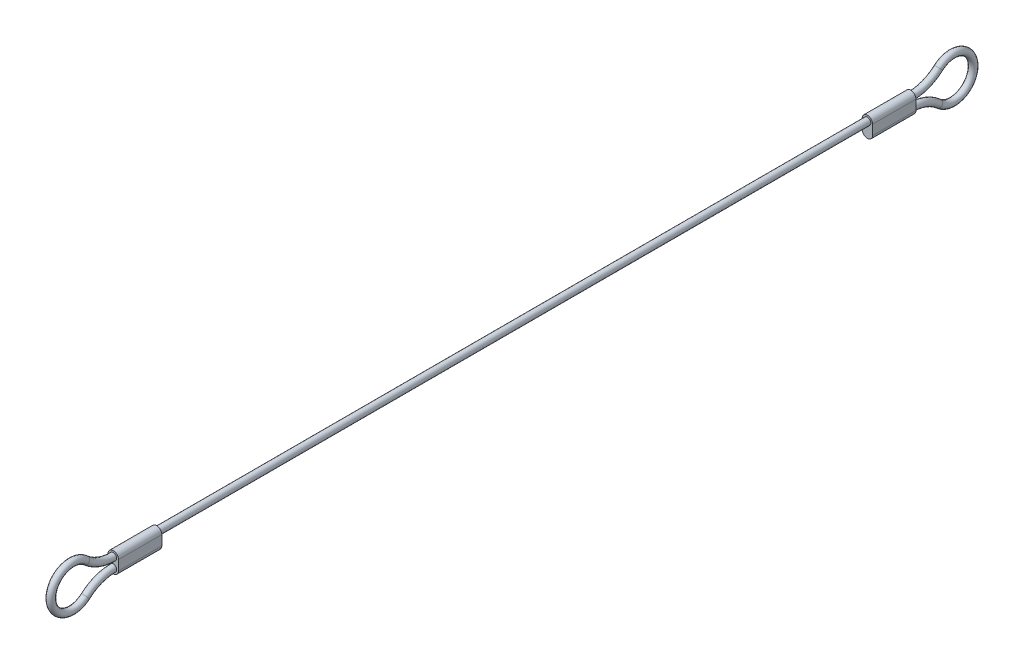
ISO-10303-21;
HEADER;
FILE_DESCRIPTION(('STEP AP214'),'2;1');
FILE_NAME('part.step','',(''),(''),'','','');
FILE_SCHEMA(('AUTOMOTIVE_DESIGN { 1 0 10303 214 1 1 1 1 }'));
ENDSEC;
DATA;
#1=APPLICATION_CONTEXT('core data for automotive mechanical design processes');
#2=APPLICATION_PROTOCOL_DEFINITION('international standard','automotive_design',2000,#1);
#3=PRODUCT_CONTEXT('',#1,'mechanical');
#4=PRODUCT('Part','Part','',(#3));
#5=PRODUCT_RELATED_PRODUCT_CATEGORY('part','',(#4));
#6=PRODUCT_DEFINITION_FORMATION('','',#4);
#7=PRODUCT_DEFINITION_CONTEXT('part definition',#1,'design');
#8=PRODUCT_DEFINITION('design','',#6,#7);
#9=PRODUCT_DEFINITION_SHAPE('','',#8);
#10=(LENGTH_UNIT() NAMED_UNIT(*) SI_UNIT(.MILLI.,.METRE.));
#11=(NAMED_UNIT(*) PLANE_ANGLE_UNIT() SI_UNIT($,.RADIAN.));
#12=(NAMED_UNIT(*) SI_UNIT($,.STERADIAN.) SOLID_ANGLE_UNIT());
#13=UNCERTAINTY_MEASURE_WITH_UNIT(LENGTH_MEASURE(1.E-05),#10,'distance_accuracy_value','');
#14=(GEOMETRIC_REPRESENTATION_CONTEXT(3) GLOBAL_UNCERTAINTY_ASSIGNED_CONTEXT((#13)) GLOBAL_UNIT_ASSIGNED_CONTEXT((#10,
#11,#12)) REPRESENTATION_CONTEXT('',''));
#15=CARTESIAN_POINT('',(0.,0.,0.));
#16=DIRECTION('',(0.,0.,1.));
#17=DIRECTION('',(1.,0.,0.));
#18=AXIS2_PLACEMENT_3D('',#15,#16,#17);
#19=CARTESIAN_POINT('',(0.,0.,-92.));
#20=DIRECTION('',(0.,0.,1.));
#21=DIRECTION('',(1.,0.,0.));
#22=AXIS2_PLACEMENT_3D('',#19,#20,#21);
#23=CYLINDRICAL_SURFACE('',#22,0.795);
#24=CARTESIAN_POINT('',(0.,0.,-82.));
#25=DIRECTION('',(0.,0.,1.));
#26=DIRECTION('',(0.,-1.,0.));
#27=AXIS2_PLACEMENT_3D('',#24,#25,#26);
#28=CIRCLE('',#27,0.795);
#29=CARTESIAN_POINT('',(0.,-0.795,-82.));
#30=VERTEX_POINT('',#29);
#31=EDGE_CURVE('E11',#30,#30,#28,.F.);
#32=ORIENTED_EDGE('',*,*,#31,.F.);
#33=EDGE_LOOP('',(#32));
#34=FACE_BOUND('',#33,.T.);
#35=CARTESIAN_POINT('',(0.,0.,82.));
#36=DIRECTION('',(0.,0.,-1.));
#37=DIRECTION('',(0.,1.,0.));
#38=AXIS2_PLACEMENT_3D('',#35,#36,#37);
#39=CIRCLE('',#38,0.795);
#40=CARTESIAN_POINT('',(0.,0.795,82.));
#41=VERTEX_POINT('',#40);
#42=EDGE_CURVE('E51',#41,#41,#39,.F.);
#43=ORIENTED_EDGE('',*,*,#42,.F.);
#44=EDGE_LOOP('',(#43));
#45=FACE_BOUND('',#44,.T.);
#46=ADVANCED_FACE('F41',(#34,#45),#23,.T.);
#47=CARTESIAN_POINT('',(0.,1.32995466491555E-13,92.));
#48=DIRECTION('',(0.,0.,-1.));
#49=DIRECTION('',(0.,1.,0.));
#50=AXIS2_PLACEMENT_3D('',#47,#48,#49);
#51=PLANE('',#50);
#52=CARTESIAN_POINT('',(0.,1.32995466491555E-13,92.));
#53=DIRECTION('',(0.,0.,-1.));
#54=DIRECTION('',(0.,1.,0.));
#55=AXIS2_PLACEMENT_3D('',#52,#53,#54);
#56=CIRCLE('',#55,1.2);
#57=CARTESIAN_POINT('',(-1.2,1.33142424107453E-13,92.));
#58=VERTEX_POINT('',#57);
#59=CARTESIAN_POINT('',(1.2,1.32848508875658E-13,92.));
#60=VERTEX_POINT('',#59);
#61=EDGE_CURVE('E186',#58,#60,#56,.T.);
#62=ORIENTED_EDGE('',*,*,#61,.F.);
#63=DIRECTION('',(0.,1.,0.));
#64=VECTOR('',#63,1.);
#65=CARTESIAN_POINT('',(-1.2,1.33142424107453E-13,92.));
#66=LINE('',#65,#64);
#67=CARTESIAN_POINT('',(-1.2,-2.26625258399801,92.));
#68=VERTEX_POINT('',#67);
#69=EDGE_CURVE('E83',#68,#58,#66,.T.);
#70=ORIENTED_EDGE('',*,*,#69,.F.);
#71=CARTESIAN_POINT('',(0.,-2.26625258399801,92.));
#72=DIRECTION('',(0.,0.,-1.));
#73=DIRECTION('',(0.,1.,0.));
#74=AXIS2_PLACEMENT_3D('',#71,#72,#73);
#75=CIRCLE('',#74,1.2);
#76=CARTESIAN_POINT('',(1.2,-2.26625258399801,92.));
#77=VERTEX_POINT('',#76);
#78=EDGE_CURVE('E77',#77,#68,#75,.T.);
#79=ORIENTED_EDGE('',*,*,#78,.F.);
#80=DIRECTION('',(0.,-1.,0.));
#81=VECTOR('',#80,1.);
#82=CARTESIAN_POINT('',(1.2,1.32848508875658E-13,92.));
#83=LINE('',#82,#81);
#84=EDGE_CURVE('E189',#60,#77,#83,.T.);
#85=ORIENTED_EDGE('',*,*,#84,.F.);
#86=EDGE_LOOP('',(#62,#70,#79,#85));
#87=FACE_BOUND('',#86,.T.);
#88=CARTESIAN_POINT('',(0.,0.,92.));
#89=DIRECTION('',(0.,0.,-1.));
#90=DIRECTION('',(0.,1.,0.));
#91=AXIS2_PLACEMENT_3D('',#88,#89,#90);
#92=CIRCLE('',#91,0.795);
#93=CARTESIAN_POINT('',(0.,-0.795000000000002,92.));
#94=VERTEX_POINT('',#93);
#95=EDGE_CURVE('E207',#94,#94,#92,.F.);
#96=ORIENTED_EDGE('',*,*,#95,.F.);
#97=EDGE_LOOP('',(#96));
#98=FACE_BOUND('',#97,.T.);
#99=CARTESIAN_POINT('',(0.,-2.26625258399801,92.));
#100=DIRECTION('',(0.,0.,-1.));
#101=DIRECTION('',(1.,0.,0.));
#102=AXIS2_PLACEMENT_3D('',#99,#100,#101);
#103=CIRCLE('',#102,0.795);
#104=CARTESIAN_POINT('',(0.,-1.47125258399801,92.));
#105=VERTEX_POINT('',#104);
#106=EDGE_CURVE('E233',#105,#105,#103,.T.);
#107=ORIENTED_EDGE('',*,*,#106,.T.);
#108=EDGE_LOOP('',(#107));
#109=FACE_BOUND('',#108,.T.);
#110=ADVANCED_FACE('F243',(#87,#98,#109),#51,.F.);
#111=CARTESIAN_POINT('',(0.,1.18539437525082E-13,82.));
#112=DIRECTION('',(0.,0.,1.));
#113=DIRECTION('',(0.,-1.,0.));
#114=AXIS2_PLACEMENT_3D('',#111,#112,#113);
#115=CYLINDRICAL_SURFACE('',#114,1.2);
#116=ORIENTED_EDGE('',*,*,#61,.T.);
#117=DIRECTION('',(0.,0.,1.));
#118=VECTOR('',#117,1.);
#119=CARTESIAN_POINT('',(1.2,1.18392479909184E-13,82.));
#120=LINE('',#119,#118);
#121=CARTESIAN_POINT('',(1.2,1.18392479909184E-13,82.));
#122=VERTEX_POINT('',#121);
#123=EDGE_CURVE('E204',#122,#60,#120,.T.);
#124=ORIENTED_EDGE('',*,*,#123,.F.);
#125=CARTESIAN_POINT('',(0.,1.18539437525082E-13,82.));
#126=DIRECTION('',(0.,0.,-1.));
#127=DIRECTION('',(0.,1.,0.));
#128=AXIS2_PLACEMENT_3D('',#125,#126,#127);
#129=CIRCLE('',#128,1.2);
#130=CARTESIAN_POINT('',(-1.2,1.1868639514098E-13,82.));
#131=VERTEX_POINT('',#130);
#132=EDGE_CURVE('E175',#131,#122,#129,.T.);
#133=ORIENTED_EDGE('',*,*,#132,.F.);
#134=DIRECTION('',(0.,0.,1.));
#135=VECTOR('',#134,1.);
#136=CARTESIAN_POINT('',(-1.2,1.1868639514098E-13,82.));
#137=LINE('',#136,#135);
#138=EDGE_CURVE('E185',#131,#58,#137,.T.);
#139=ORIENTED_EDGE('',*,*,#138,.T.);
#140=EDGE_LOOP('',(#116,#124,#133,#139));
#141=FACE_BOUND('',#140,.T.);
#142=ADVANCED_FACE('F249',(#141),#115,.T.);
#143=CARTESIAN_POINT('',(1.2,1.18392479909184E-13,82.));
#144=DIRECTION('',(-1.,0.,0.));
#145=DIRECTION('',(0.,0.,1.));
#146=AXIS2_PLACEMENT_3D('',#143,#144,#145);
#147=PLANE('',#146);
#148=ORIENTED_EDGE('',*,*,#84,.T.);
#149=DIRECTION('',(0.,0.,1.));
#150=VECTOR('',#149,1.);
#151=CARTESIAN_POINT('',(1.2,-2.26625258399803,82.));
#152=LINE('',#151,#150);
#153=CARTESIAN_POINT('',(1.2,-2.26625258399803,82.));
#154=VERTEX_POINT('',#153);
#155=EDGE_CURVE('E201',#154,#77,#152,.T.);
#156=ORIENTED_EDGE('',*,*,#155,.F.);
#157=DIRECTION('',(0.,-1.,0.));
#158=VECTOR('',#157,1.);
#159=CARTESIAN_POINT('',(1.2,1.18392479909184E-13,82.));
#160=LINE('',#159,#158);
#161=EDGE_CURVE('E91',#122,#154,#160,.T.);
#162=ORIENTED_EDGE('',*,*,#161,.F.);
#163=ORIENTED_EDGE('',*,*,#123,.T.);
#164=EDGE_LOOP('',(#148,#156,#162,#163));
#165=FACE_BOUND('',#164,.T.);
#166=ADVANCED_FACE('F291',(#165),#147,.F.);
#167=CARTESIAN_POINT('',(0.,-2.26625258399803,82.));
#168=DIRECTION('',(0.,0.,1.));
#169=DIRECTION('',(0.,-1.,0.));
#170=AXIS2_PLACEMENT_3D('',#167,#168,#169);
#171=CYLINDRICAL_SURFACE('',#170,1.2);
#172=ORIENTED_EDGE('',*,*,#78,.T.);
#173=DIRECTION('',(0.,0.,1.));
#174=VECTOR('',#173,1.);
#175=CARTESIAN_POINT('',(-1.2,-2.26625258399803,82.));
#176=LINE('',#175,#174);
#177=CARTESIAN_POINT('',(-1.2,-2.26625258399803,82.));
#178=VERTEX_POINT('',#177);
#179=EDGE_CURVE('E198',#178,#68,#176,.T.);
#180=ORIENTED_EDGE('',*,*,#179,.F.);
#181=CARTESIAN_POINT('',(0.,-2.26625258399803,82.));
#182=DIRECTION('',(0.,0.,-1.));
#183=DIRECTION('',(0.,1.,0.));
#184=AXIS2_PLACEMENT_3D('',#181,#182,#183);
#185=CIRCLE('',#184,1.2);
#186=EDGE_CURVE('E180',#154,#178,#185,.T.);
#187=ORIENTED_EDGE('',*,*,#186,.F.);
#188=ORIENTED_EDGE('',*,*,#155,.T.);
#189=EDGE_LOOP('',(#172,#180,#187,#188));
#190=FACE_BOUND('',#189,.T.);
#191=ADVANCED_FACE('F284',(#190),#171,.T.);
#192=CARTESIAN_POINT('',(-1.2,1.1868639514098E-13,82.));
#193=DIRECTION('',(1.,0.,0.));
#194=DIRECTION('',(0.,1.,0.));
#195=AXIS2_PLACEMENT_3D('',#192,#193,#194);
#196=PLANE('',#195);
#197=ORIENTED_EDGE('',*,*,#69,.T.);
#198=ORIENTED_EDGE('',*,*,#138,.F.);
#199=DIRECTION('',(0.,1.,0.));
#200=VECTOR('',#199,1.);
#201=CARTESIAN_POINT('',(-1.2,1.1868639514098E-13,82.));
#202=LINE('',#201,#200);
#203=EDGE_CURVE('E59',#178,#131,#202,.T.);
#204=ORIENTED_EDGE('',*,*,#203,.F.);
#205=ORIENTED_EDGE('',*,*,#179,.T.);
#206=EDGE_LOOP('',(#197,#198,#204,#205));
#207=FACE_BOUND('',#206,.T.);
#208=ADVANCED_FACE('F279',(#207),#196,.F.);
#209=CARTESIAN_POINT('',(0.,1.18539437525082E-13,82.));
#210=DIRECTION('',(0.,0.,-1.));
#211=DIRECTION('',(0.,1.,0.));
#212=AXIS2_PLACEMENT_3D('',#209,#210,#211);
#213=PLANE('',#212);
#214=ORIENTED_EDGE('',*,*,#42,.T.);
#215=EDGE_LOOP('',(#214));
#216=FACE_BOUND('',#215,.T.);
#217=ORIENTED_EDGE('',*,*,#132,.T.);
#218=ORIENTED_EDGE('',*,*,#161,.T.);
#219=ORIENTED_EDGE('',*,*,#186,.T.);
#220=ORIENTED_EDGE('',*,*,#203,.T.);
#221=EDGE_LOOP('',(#217,#218,#219,#220));
#222=FACE_BOUND('',#221,.T.);
#223=ADVANCED_FACE('F240',(#216,#222),#213,.T.);
#224=CARTESIAN_POINT('',(0.,-11.866252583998,92.));
#225=DIRECTION('',(-1.,0.,0.));
#226=DIRECTION('',(0.,0.,1.));
#227=AXIS2_PLACEMENT_3D('',#224,#225,#226);
#228=TOROIDAL_SURFACE('',#227,9.59999999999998,0.795);
#229=CARTESIAN_POINT('',(0.,-4.71083505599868,98.4));
#230=DIRECTION('',(0.,0.666666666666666,-0.74535599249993));
#231=DIRECTION('',(1.,0.,0.));
#232=AXIS2_PLACEMENT_3D('',#229,#230,#231);
#233=CIRCLE('',#232,0.795);
#234=CARTESIAN_POINT('',(0.,-4.11827704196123,98.93));
#235=VERTEX_POINT('',#234);
#236=EDGE_CURVE('E229',#235,#235,#233,.T.);
#237=CARTESIAN_POINT('',(0.,-11.866252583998,92.));
#238=DIRECTION('',(-1.,0.,0.));
#239=DIRECTION('',(0.,0.,1.));
#240=AXIS2_PLACEMENT_3D('',#237,#238,#239);
#241=CIRCLE('',#240,10.395);
#242=EDGE_CURVE('',#235,#105,#241,.T.);
#243=ORIENTED_EDGE('',*,*,#236,.T.);
#244=ORIENTED_EDGE('',*,*,#106,.F.);
#245=ORIENTED_EDGE('',*,*,#242,.T.);
#246=ORIENTED_EDGE('',*,*,#242,.F.);
#247=EDGE_LOOP('',(#243,#245,#244,#246));
#248=FACE_BOUND('',#247,.T.);
#249=ADVANCED_FACE('F43',(#248),#228,.T.);
#250=CARTESIAN_POINT('',(0.,-1.133126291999,101.6));
#251=DIRECTION('',(1.,0.,0.));
#252=DIRECTION('',(0.,0.,-1.));
#253=AXIS2_PLACEMENT_3D('',#250,#251,#252);
#254=TOROIDAL_SURFACE('',#253,4.80000000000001,0.795);
#255=ORIENTED_EDGE('',*,*,#236,.F.);
#256=EDGE_LOOP('',(#255));
#257=FACE_BOUND('',#256,.T.);
#258=CARTESIAN_POINT('',(0.,2.44458247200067,98.4));
#259=DIRECTION('',(0.,0.666666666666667,0.74535599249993));
#260=DIRECTION('',(1.,0.,0.));
#261=AXIS2_PLACEMENT_3D('',#258,#259,#260);
#262=CIRCLE('',#261,0.795);
#263=CARTESIAN_POINT('',(0.,1.85202445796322,98.93));
#264=VERTEX_POINT('',#263);
#265=EDGE_CURVE('E225',#264,#264,#262,.T.);
#266=ORIENTED_EDGE('',*,*,#265,.T.);
#267=EDGE_LOOP('',(#266));
#268=FACE_BOUND('',#267,.T.);
#269=ADVANCED_FACE('F259',(#257,#268),#254,.T.);
#270=CARTESIAN_POINT('',(0.,9.59999999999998,92.));
#271=DIRECTION('',(-1.,0.,0.));
#272=DIRECTION('',(0.,0.,1.));
#273=AXIS2_PLACEMENT_3D('',#270,#271,#272);
#274=TOROIDAL_SURFACE('',#273,9.59999999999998,0.795);
#275=CARTESIAN_POINT('',(0.,9.59999999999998,92.));
#276=DIRECTION('',(-1.,0.,0.));
#277=DIRECTION('',(0.,0.,1.));
#278=AXIS2_PLACEMENT_3D('',#275,#276,#277);
#279=CIRCLE('',#278,10.395);
#280=EDGE_CURVE('',#94,#264,#279,.T.);
#281=ORIENTED_EDGE('',*,*,#95,.T.);
#282=ORIENTED_EDGE('',*,*,#265,.F.);
#283=ORIENTED_EDGE('',*,*,#280,.T.);
#284=ORIENTED_EDGE('',*,*,#280,.F.);
#285=EDGE_LOOP('',(#281,#283,#282,#284));
#286=FACE_BOUND('',#285,.T.);
#287=ADVANCED_FACE('F257',(#286),#274,.T.);
#288=CARTESIAN_POINT('',(0.,1.18539437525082E-13,-82.));
#289=DIRECTION('',(0.,0.,-1.));
#290=DIRECTION('',(0.,1.,0.));
#291=AXIS2_PLACEMENT_3D('',#288,#289,#290);
#292=CYLINDRICAL_SURFACE('',#291,1.2);
#293=CARTESIAN_POINT('',(0.,1.32995466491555E-13,-92.));
#294=DIRECTION('',(0.,0.,-1.));
#295=DIRECTION('',(0.,1.,0.));
#296=AXIS2_PLACEMENT_3D('',#293,#294,#295);
#297=CIRCLE('',#296,1.2);
#298=CARTESIAN_POINT('',(-1.2,1.33142424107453E-13,-92.));
#299=VERTEX_POINT('',#298);
#300=CARTESIAN_POINT('',(1.2,1.32848508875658E-13,-92.));
#301=VERTEX_POINT('',#300);
#302=EDGE_CURVE('E124',#299,#301,#297,.T.);
#303=ORIENTED_EDGE('',*,*,#302,.F.);
#304=DIRECTION('',(0.,0.,-1.));
#305=VECTOR('',#304,1.);
#306=CARTESIAN_POINT('',(-1.2,1.1868639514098E-13,-82.));
#307=LINE('',#306,#305);
#308=CARTESIAN_POINT('',(-1.2,1.1868639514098E-13,-82.));
#309=VERTEX_POINT('',#308);
#310=EDGE_CURVE('E118',#309,#299,#307,.T.);
#311=ORIENTED_EDGE('',*,*,#310,.F.);
#312=CARTESIAN_POINT('',(0.,1.18539437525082E-13,-82.));
#313=DIRECTION('',(0.,0.,-1.));
#314=DIRECTION('',(0.,1.,0.));
#315=AXIS2_PLACEMENT_3D('',#312,#313,#314);
#316=CIRCLE('',#315,1.2);
#317=CARTESIAN_POINT('',(1.2,1.18392479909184E-13,-82.));
#318=VERTEX_POINT('',#317);
#319=EDGE_CURVE('E121',#309,#318,#316,.T.);
#320=ORIENTED_EDGE('',*,*,#319,.T.);
#321=DIRECTION('',(0.,0.,-1.));
#322=VECTOR('',#321,1.);
#323=CARTESIAN_POINT('',(1.2,1.18392479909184E-13,-82.));
#324=LINE('',#323,#322);
#325=EDGE_CURVE('E155',#318,#301,#324,.T.);
#326=ORIENTED_EDGE('',*,*,#325,.T.);
#327=EDGE_LOOP('',(#303,#311,#320,#326));
#328=FACE_BOUND('',#327,.T.);
#329=ADVANCED_FACE('F120',(#328),#292,.T.);
#330=CARTESIAN_POINT('',(-1.2,1.1868639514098E-13,-82.));
#331=DIRECTION('',(-1.,0.,0.));
#332=DIRECTION('',(0.,-1.,0.));
#333=AXIS2_PLACEMENT_3D('',#330,#331,#332);
#334=PLANE('',#333);
#335=DIRECTION('',(0.,1.,0.));
#336=VECTOR('',#335,1.);
#337=CARTESIAN_POINT('',(-1.2,1.33142424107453E-13,-92.));
#338=LINE('',#337,#336);
#339=CARTESIAN_POINT('',(-1.2,-2.26625258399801,-92.));
#340=VERTEX_POINT('',#339);
#341=EDGE_CURVE('E158',#340,#299,#338,.T.);
#342=ORIENTED_EDGE('',*,*,#341,.F.);
#343=DIRECTION('',(0.,0.,-1.));
#344=VECTOR('',#343,1.);
#345=CARTESIAN_POINT('',(-1.2,-2.26625258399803,-82.));
#346=LINE('',#345,#344);
#347=CARTESIAN_POINT('',(-1.2,-2.26625258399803,-82.));
#348=VERTEX_POINT('',#347);
#349=EDGE_CURVE('E131',#348,#340,#346,.T.);
#350=ORIENTED_EDGE('',*,*,#349,.F.);
#351=DIRECTION('',(0.,1.,0.));
#352=VECTOR('',#351,1.);
#353=CARTESIAN_POINT('',(-1.2,1.1868639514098E-13,-82.));
#354=LINE('',#353,#352);
#355=EDGE_CURVE('E137',#348,#309,#354,.T.);
#356=ORIENTED_EDGE('',*,*,#355,.T.);
#357=ORIENTED_EDGE('',*,*,#310,.T.);
#358=EDGE_LOOP('',(#342,#350,#356,#357));
#359=FACE_BOUND('',#358,.T.);
#360=ADVANCED_FACE('F144',(#359),#334,.T.);
#361=CARTESIAN_POINT('',(0.,-2.26625258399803,-82.));
#362=DIRECTION('',(0.,0.,-1.));
#363=DIRECTION('',(0.,1.,0.));
#364=AXIS2_PLACEMENT_3D('',#361,#362,#363);
#365=CYLINDRICAL_SURFACE('',#364,1.2);
#366=CARTESIAN_POINT('',(0.,-2.26625258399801,-92.));
#367=DIRECTION('',(0.,0.,-1.));
#368=DIRECTION('',(0.,1.,0.));
#369=AXIS2_PLACEMENT_3D('',#366,#367,#368);
#370=CIRCLE('',#369,1.2);
#371=CARTESIAN_POINT('',(1.2,-2.26625258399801,-92.));
#372=VERTEX_POINT('',#371);
#373=EDGE_CURVE('E161',#372,#340,#370,.T.);
#374=ORIENTED_EDGE('',*,*,#373,.F.);
#375=DIRECTION('',(0.,0.,-1.));
#376=VECTOR('',#375,1.);
#377=CARTESIAN_POINT('',(1.2,-2.26625258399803,-82.));
#378=LINE('',#377,#376);
#379=CARTESIAN_POINT('',(1.2,-2.26625258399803,-82.));
#380=VERTEX_POINT('',#379);
#381=EDGE_CURVE('E170',#380,#372,#378,.T.);
#382=ORIENTED_EDGE('',*,*,#381,.F.);
#383=CARTESIAN_POINT('',(0.,-2.26625258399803,-82.));
#384=DIRECTION('',(0.,0.,-1.));
#385=DIRECTION('',(0.,1.,0.));
#386=AXIS2_PLACEMENT_3D('',#383,#384,#385);
#387=CIRCLE('',#386,1.2);
#388=EDGE_CURVE('E146',#380,#348,#387,.T.);
#389=ORIENTED_EDGE('',*,*,#388,.T.);
#390=ORIENTED_EDGE('',*,*,#349,.T.);
#391=EDGE_LOOP('',(#374,#382,#389,#390));
#392=FACE_BOUND('',#391,.T.);
#393=ADVANCED_FACE('F324',(#392),#365,.T.);
#394=CARTESIAN_POINT('',(1.2,1.18392479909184E-13,-82.));
#395=DIRECTION('',(1.,0.,0.));
#396=DIRECTION('',(0.,0.,-1.));
#397=AXIS2_PLACEMENT_3D('',#394,#395,#396);
#398=PLANE('',#397);
#399=DIRECTION('',(0.,-1.,0.));
#400=VECTOR('',#399,1.);
#401=CARTESIAN_POINT('',(1.2,1.32848508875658E-13,-92.));
#402=LINE('',#401,#400);
#403=EDGE_CURVE('E142',#301,#372,#402,.T.);
#404=ORIENTED_EDGE('',*,*,#403,.F.);
#405=ORIENTED_EDGE('',*,*,#325,.F.);
#406=DIRECTION('',(0.,-1.,0.));
#407=VECTOR('',#406,1.);
#408=CARTESIAN_POINT('',(1.2,1.18392479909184E-13,-82.));
#409=LINE('',#408,#407);
#410=EDGE_CURVE('E140',#318,#380,#409,.T.);
#411=ORIENTED_EDGE('',*,*,#410,.T.);
#412=ORIENTED_EDGE('',*,*,#381,.T.);
#413=EDGE_LOOP('',(#404,#405,#411,#412));
#414=FACE_BOUND('',#413,.T.);
#415=ADVANCED_FACE('F321',(#414),#398,.T.);
#416=CARTESIAN_POINT('',(0.,1.18539437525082E-13,-82.));
#417=DIRECTION('',(0.,0.,1.));
#418=DIRECTION('',(0.,1.,0.));
#419=AXIS2_PLACEMENT_3D('',#416,#417,#418);
#420=PLANE('',#419);
#421=ORIENTED_EDGE('',*,*,#31,.T.);
#422=EDGE_LOOP('',(#421));
#423=FACE_BOUND('',#422,.T.);
#424=ORIENTED_EDGE('',*,*,#319,.F.);
#425=ORIENTED_EDGE('',*,*,#355,.F.);
#426=ORIENTED_EDGE('',*,*,#388,.F.);
#427=ORIENTED_EDGE('',*,*,#410,.F.);
#428=EDGE_LOOP('',(#424,#425,#426,#427));
#429=FACE_BOUND('',#428,.T.);
#430=ADVANCED_FACE('F135',(#423,#429),#420,.T.);
#431=CARTESIAN_POINT('',(0.,1.32995466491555E-13,-92.));
#432=DIRECTION('',(0.,0.,1.));
#433=DIRECTION('',(0.,1.,0.));
#434=AXIS2_PLACEMENT_3D('',#431,#432,#433);
#435=PLANE('',#434);
#436=CARTESIAN_POINT('',(0.,-2.26625258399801,-92.));
#437=DIRECTION('',(0.,0.,-1.));
#438=DIRECTION('',(1.,0.,0.));
#439=AXIS2_PLACEMENT_3D('',#436,#437,#438);
#440=CIRCLE('',#439,0.795);
#441=CARTESIAN_POINT('',(0.,-1.47125258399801,-92.));
#442=VERTEX_POINT('',#441);
#443=EDGE_CURVE('E130',#442,#442,#440,.T.);
#444=ORIENTED_EDGE('',*,*,#443,.F.);
#445=EDGE_LOOP('',(#444));
#446=FACE_BOUND('',#445,.T.);
#447=CARTESIAN_POINT('',(0.,0.,-92.));
#448=DIRECTION('',(0.,0.,1.));
#449=DIRECTION('',(1.,0.,0.));
#450=AXIS2_PLACEMENT_3D('',#447,#448,#449);
#451=CIRCLE('',#450,0.795);
#452=CARTESIAN_POINT('',(0.,-0.795000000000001,-92.));
#453=VERTEX_POINT('',#452);
#454=EDGE_CURVE('E221',#453,#453,#451,.T.);
#455=ORIENTED_EDGE('',*,*,#454,.T.);
#456=EDGE_LOOP('',(#455));
#457=FACE_BOUND('',#456,.T.);
#458=ORIENTED_EDGE('',*,*,#302,.T.);
#459=ORIENTED_EDGE('',*,*,#403,.T.);
#460=ORIENTED_EDGE('',*,*,#373,.T.);
#461=ORIENTED_EDGE('',*,*,#341,.T.);
#462=EDGE_LOOP('',(#458,#459,#460,#461));
#463=FACE_BOUND('',#462,.T.);
#464=ADVANCED_FACE('F300',(#446,#457,#463),#435,.F.);
#465=CARTESIAN_POINT('',(0.,-11.866252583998,-92.));
#466=DIRECTION('',(-1.,0.,0.));
#467=DIRECTION('',(0.,0.,1.));
#468=AXIS2_PLACEMENT_3D('',#465,#466,#467);
#469=TOROIDAL_SURFACE('',#468,9.59999999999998,0.795);
#470=CARTESIAN_POINT('',(0.,-4.71083505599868,-98.4));
#471=DIRECTION('',(0.,-0.666666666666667,-0.74535599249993));
#472=DIRECTION('',(1.,0.,0.));
#473=AXIS2_PLACEMENT_3D('',#470,#471,#472);
#474=CIRCLE('',#473,0.795);
#475=CARTESIAN_POINT('',(0.,-4.11827704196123,-98.93));
#476=VERTEX_POINT('',#475);
#477=EDGE_CURVE('E210',#476,#476,#474,.T.);
#478=CARTESIAN_POINT('',(0.,-11.866252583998,-92.));
#479=DIRECTION('',(-1.,0.,0.));
#480=DIRECTION('',(0.,0.,1.));
#481=AXIS2_PLACEMENT_3D('',#478,#479,#480);
#482=CIRCLE('',#481,10.395);
#483=EDGE_CURVE('',#442,#476,#482,.T.);
#484=ORIENTED_EDGE('',*,*,#443,.T.);
#485=ORIENTED_EDGE('',*,*,#477,.F.);
#486=ORIENTED_EDGE('',*,*,#483,.T.);
#487=ORIENTED_EDGE('',*,*,#483,.F.);
#488=EDGE_LOOP('',(#484,#486,#485,#487));
#489=FACE_BOUND('',#488,.T.);
#490=ADVANCED_FACE('F297',(#489),#469,.T.);
#491=CARTESIAN_POINT('',(0.,-1.133126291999,-101.6));
#492=DIRECTION('',(1.,0.,0.));
#493=DIRECTION('',(0.,0.,-1.));
#494=AXIS2_PLACEMENT_3D('',#491,#492,#493);
#495=TOROIDAL_SURFACE('',#494,4.80000000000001,0.795);
#496=CARTESIAN_POINT('',(0.,2.44458247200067,-98.4));
#497=DIRECTION('',(0.,-0.666666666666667,0.74535599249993));
#498=DIRECTION('',(1.,0.,0.));
#499=AXIS2_PLACEMENT_3D('',#496,#497,#498);
#500=CIRCLE('',#499,0.795);
#501=CARTESIAN_POINT('',(0.,1.85202445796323,-98.93));
#502=VERTEX_POINT('',#501);
#503=EDGE_CURVE('E217',#502,#502,#500,.T.);
#504=ORIENTED_EDGE('',*,*,#503,.F.);
#505=EDGE_LOOP('',(#504));
#506=FACE_BOUND('',#505,.T.);
#507=ORIENTED_EDGE('',*,*,#477,.T.);
#508=EDGE_LOOP('',(#507));
#509=FACE_BOUND('',#508,.T.);
#510=ADVANCED_FACE('F299',(#506,#509),#495,.T.);
#511=CARTESIAN_POINT('',(0.,9.59999999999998,-92.));
#512=DIRECTION('',(-1.,0.,0.));
#513=DIRECTION('',(0.,0.,1.));
#514=AXIS2_PLACEMENT_3D('',#511,#512,#513);
#515=TOROIDAL_SURFACE('',#514,9.59999999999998,0.795);
#516=CARTESIAN_POINT('',(0.,9.59999999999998,-92.));
#517=DIRECTION('',(-1.,0.,0.));
#518=DIRECTION('',(0.,0.,1.));
#519=AXIS2_PLACEMENT_3D('',#516,#517,#518);
#520=CIRCLE('',#519,10.395);
#521=EDGE_CURVE('',#502,#453,#520,.T.);
#522=ORIENTED_EDGE('',*,*,#503,.T.);
#523=ORIENTED_EDGE('',*,*,#454,.F.);
#524=ORIENTED_EDGE('',*,*,#521,.T.);
#525=ORIENTED_EDGE('',*,*,#521,.F.);
#526=EDGE_LOOP('',(#522,#524,#523,#525));
#527=FACE_BOUND('',#526,.T.);
#528=ADVANCED_FACE('F255',(#527),#515,.T.);
#529=CLOSED_SHELL('',(#46,#110,#142,#166,#191,#208,#223,#249,#269,#287,#329,#360,#393,#415,#430,
#464,#490,#510,#528));
#530=MANIFOLD_SOLID_BREP('B2',#529);
#531=ADVANCED_BREP_SHAPE_REPRESENTATION('',(#18,#530),#14);
#532=SHAPE_DEFINITION_REPRESENTATION(#9,#531);
ENDSEC;
END-ISO-10303-21;
